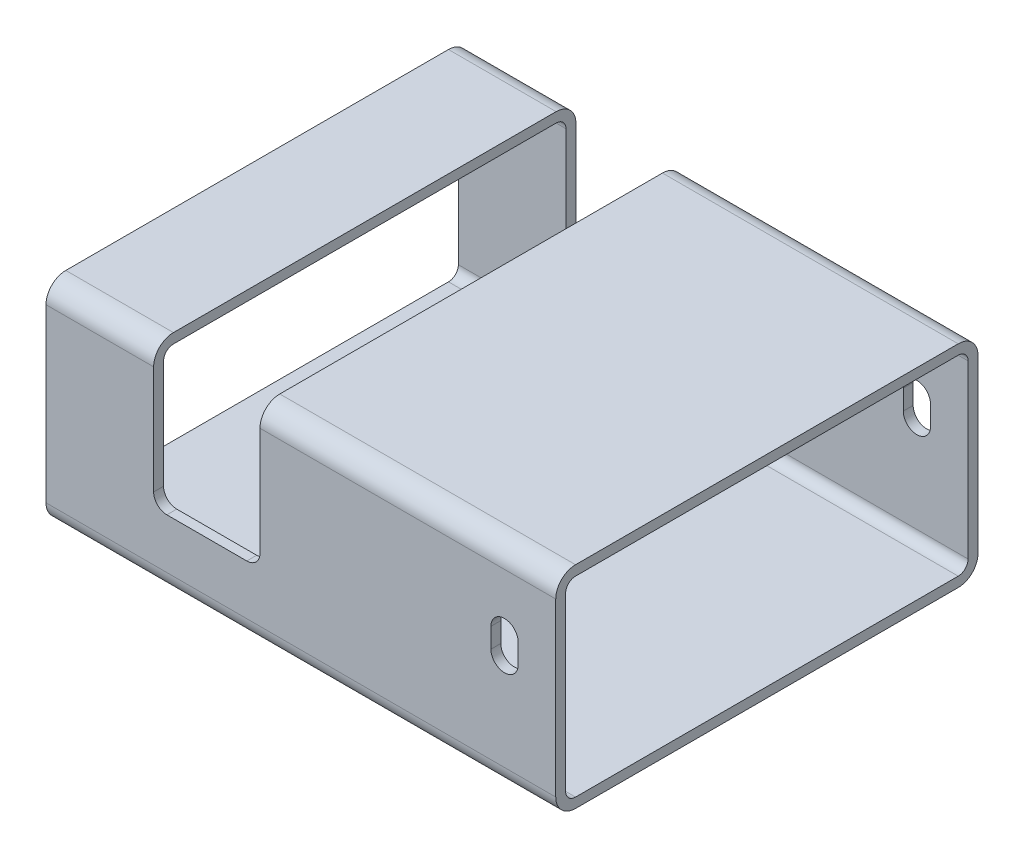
ISO-10303-21;
HEADER;
FILE_DESCRIPTION(('STEP AP214'),'2;1');
FILE_NAME('part.step','',(''),(''),'','','');
FILE_SCHEMA(('AUTOMOTIVE_DESIGN { 1 0 10303 214 1 1 1 1 }'));
ENDSEC;
DATA;
#1=APPLICATION_CONTEXT('core data for automotive mechanical design processes');
#2=APPLICATION_PROTOCOL_DEFINITION('international standard','automotive_design',2000,#1);
#3=PRODUCT_CONTEXT('',#1,'mechanical');
#4=PRODUCT('Part','Part','',(#3));
#5=PRODUCT_RELATED_PRODUCT_CATEGORY('part','',(#4));
#6=PRODUCT_DEFINITION_FORMATION('','',#4);
#7=PRODUCT_DEFINITION_CONTEXT('part definition',#1,'design');
#8=PRODUCT_DEFINITION('design','',#6,#7);
#9=PRODUCT_DEFINITION_SHAPE('','',#8);
#10=(LENGTH_UNIT() NAMED_UNIT(*) SI_UNIT(.MILLI.,.METRE.));
#11=(NAMED_UNIT(*) PLANE_ANGLE_UNIT() SI_UNIT($,.RADIAN.));
#12=(NAMED_UNIT(*) SI_UNIT($,.STERADIAN.) SOLID_ANGLE_UNIT());
#13=UNCERTAINTY_MEASURE_WITH_UNIT(LENGTH_MEASURE(1.E-05),#10,'distance_accuracy_value','');
#14=(GEOMETRIC_REPRESENTATION_CONTEXT(3) GLOBAL_UNCERTAINTY_ASSIGNED_CONTEXT((#13)) GLOBAL_UNIT_ASSIGNED_CONTEXT((#10,
#11,#12)) REPRESENTATION_CONTEXT('',''));
#15=CARTESIAN_POINT('',(0.,0.,0.));
#16=DIRECTION('',(0.,0.,1.));
#17=DIRECTION('',(1.,0.,0.));
#18=AXIS2_PLACEMENT_3D('',#15,#16,#17);
#19=CARTESIAN_POINT('',(245.3005,41.275,92.075));
#20=DIRECTION('',(-1.,0.,0.));
#21=DIRECTION('',(0.,0.,1.));
#22=AXIS2_PLACEMENT_3D('',#19,#20,#21);
#23=CYLINDRICAL_SURFACE('',#22,9.52499999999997);
#24=DIRECTION('',(-1.,0.,0.));
#25=VECTOR('',#24,1.);
#26=CARTESIAN_POINT('',(245.3005,50.8,92.075));
#27=LINE('',#26,#25);
#28=CARTESIAN_POINT('',(245.3005,50.8,92.075));
#29=VERTEX_POINT('',#28);
#30=CARTESIAN_POINT('',(102.981,50.8,92.075));
#31=VERTEX_POINT('',#30);
#32=EDGE_CURVE('E539',#29,#31,#27,.T.);
#33=ORIENTED_EDGE('',*,*,#32,.T.);
#34=CARTESIAN_POINT('',(102.981,41.275,92.075));
#35=DIRECTION('',(1.,0.,0.));
#36=DIRECTION('',(0.,0.,-1.));
#37=AXIS2_PLACEMENT_3D('',#34,#35,#36);
#38=CIRCLE('',#37,9.52499999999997);
#39=CARTESIAN_POINT('',(102.981,41.275,101.6));
#40=VERTEX_POINT('',#39);
#41=EDGE_CURVE('E383',#31,#40,#38,.T.);
#42=ORIENTED_EDGE('',*,*,#41,.T.);
#43=DIRECTION('',(-1.,0.,0.));
#44=VECTOR('',#43,1.);
#45=CARTESIAN_POINT('',(245.3005,41.275,101.6));
#46=LINE('',#45,#44);
#47=CARTESIAN_POINT('',(245.3005,41.275,101.6));
#48=VERTEX_POINT('',#47);
#49=EDGE_CURVE('E562',#48,#40,#46,.T.);
#50=ORIENTED_EDGE('',*,*,#49,.F.);
#51=CARTESIAN_POINT('',(245.3005,41.275,92.075));
#52=DIRECTION('',(1.,0.,0.));
#53=DIRECTION('',(0.,0.,-1.));
#54=AXIS2_PLACEMENT_3D('',#51,#52,#53);
#55=CIRCLE('',#54,9.52499999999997);
#56=EDGE_CURVE('E503',#29,#48,#55,.T.);
#57=ORIENTED_EDGE('',*,*,#56,.F.);
#58=EDGE_LOOP('',(#33,#42,#50,#57));
#59=FACE_BOUND('',#58,.T.);
#60=ADVANCED_FACE('F41',(#59),#23,.T.);
#61=CARTESIAN_POINT('',(245.3005,41.275,101.6));
#62=DIRECTION('',(0.,0.,-1.));
#63=DIRECTION('',(-1.,0.,0.));
#64=AXIS2_PLACEMENT_3D('',#61,#62,#63);
#65=PLANE('',#64);
#66=DIRECTION('',(0.,1.,0.));
#67=VECTOR('',#66,1.);
#68=CARTESIAN_POINT('',(227.1949375,4.7625,101.6));
#69=LINE('',#68,#67);
#70=CARTESIAN_POINT('',(227.1949375,4.7625,101.6));
#71=VERTEX_POINT('',#70);
#72=CARTESIAN_POINT('',(227.1949375,14.2875,101.6));
#73=VERTEX_POINT('',#72);
#74=EDGE_CURVE('E389',#71,#73,#69,.T.);
#75=ORIENTED_EDGE('',*,*,#74,.F.);
#76=CARTESIAN_POINT('',(220.6465,4.7625,101.6));
#77=DIRECTION('',(0.,0.,1.));
#78=DIRECTION('',(1.,0.,0.));
#79=AXIS2_PLACEMENT_3D('',#76,#77,#78);
#80=CIRCLE('',#79,6.54843749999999);
#81=CARTESIAN_POINT('',(214.0980625,4.7625,101.6));
#82=VERTEX_POINT('',#81);
#83=EDGE_CURVE('E387',#82,#71,#80,.T.);
#84=ORIENTED_EDGE('',*,*,#83,.F.);
#85=DIRECTION('',(0.,-1.,0.));
#86=VECTOR('',#85,1.);
#87=CARTESIAN_POINT('',(214.0980625,4.7625,101.6));
#88=LINE('',#87,#86);
#89=CARTESIAN_POINT('',(214.0980625,14.2875,101.6));
#90=VERTEX_POINT('',#89);
#91=EDGE_CURVE('E397',#90,#82,#88,.T.);
#92=ORIENTED_EDGE('',*,*,#91,.F.);
#93=CARTESIAN_POINT('',(220.6465,14.2875,101.6));
#94=DIRECTION('',(0.,0.,1.));
#95=DIRECTION('',(1.,0.,0.));
#96=AXIS2_PLACEMENT_3D('',#93,#94,#95);
#97=CIRCLE('',#96,6.54843749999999);
#98=EDGE_CURVE('E393',#73,#90,#97,.T.);
#99=ORIENTED_EDGE('',*,*,#98,.F.);
#100=EDGE_LOOP('',(#75,#84,#92,#99));
#101=FACE_BOUND('',#100,.T.);
#102=DIRECTION('',(0.,-1.,0.));
#103=VECTOR('',#102,1.);
#104=CARTESIAN_POINT('',(51.8,-10.8584999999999,101.6));
#105=LINE('',#104,#103);
#106=CARTESIAN_POINT('',(51.8,41.275,101.6));
#107=VERTEX_POINT('',#106);
#108=CARTESIAN_POINT('',(51.8,-10.8584999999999,101.6));
#109=VERTEX_POINT('',#108);
#110=EDGE_CURVE('E295',#107,#109,#105,.T.);
#111=ORIENTED_EDGE('',*,*,#110,.F.);
#112=CARTESIAN_POINT('',(0.,41.275,101.6));
#113=VERTEX_POINT('',#112);
#114=EDGE_CURVE('E563',#107,#113,#46,.T.);
#115=ORIENTED_EDGE('',*,*,#114,.T.);
#116=DIRECTION('',(0.,-1.,0.));
#117=VECTOR('',#116,1.);
#118=CARTESIAN_POINT('',(0.,41.275,101.6));
#119=LINE('',#118,#117);
#120=CARTESIAN_POINT('',(0.,-41.275,101.6));
#121=VERTEX_POINT('',#120);
#122=EDGE_CURVE('E522',#113,#121,#119,.T.);
#123=ORIENTED_EDGE('',*,*,#122,.T.);
#124=DIRECTION('',(-1.,0.,0.));
#125=VECTOR('',#124,1.);
#126=CARTESIAN_POINT('',(245.3005,-41.275,101.6));
#127=LINE('',#126,#125);
#128=CARTESIAN_POINT('',(245.3005,-41.275,101.6));
#129=VERTEX_POINT('',#128);
#130=EDGE_CURVE('E557',#129,#121,#127,.T.);
#131=ORIENTED_EDGE('',*,*,#130,.F.);
#132=DIRECTION('',(0.,-1.,0.));
#133=VECTOR('',#132,1.);
#134=CARTESIAN_POINT('',(245.3005,41.275,101.6));
#135=LINE('',#134,#133);
#136=EDGE_CURVE('E506',#48,#129,#135,.T.);
#137=ORIENTED_EDGE('',*,*,#136,.F.);
#138=ORIENTED_EDGE('',*,*,#49,.T.);
#139=DIRECTION('',(0.,1.,0.));
#140=VECTOR('',#139,1.);
#141=CARTESIAN_POINT('',(102.981,-10.8584999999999,101.6));
#142=LINE('',#141,#140);
#143=CARTESIAN_POINT('',(102.981,-10.8584999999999,101.6));
#144=VERTEX_POINT('',#143);
#145=EDGE_CURVE('E323',#144,#40,#142,.T.);
#146=ORIENTED_EDGE('',*,*,#145,.F.);
#147=CARTESIAN_POINT('',(96.631,-10.8585,101.6));
#148=DIRECTION('',(0.,0.,1.));
#149=DIRECTION('',(1.,0.,0.));
#150=AXIS2_PLACEMENT_3D('',#147,#148,#149);
#151=CIRCLE('',#150,6.35);
#152=CARTESIAN_POINT('',(96.6309999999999,-17.2085,101.6));
#153=VERTEX_POINT('',#152);
#154=EDGE_CURVE('E316',#153,#144,#151,.T.);
#155=ORIENTED_EDGE('',*,*,#154,.F.);
#156=DIRECTION('',(1.,0.,0.));
#157=VECTOR('',#156,1.);
#158=CARTESIAN_POINT('',(58.15,-17.2085,101.6));
#159=LINE('',#158,#157);
#160=CARTESIAN_POINT('',(58.15,-17.2085,101.6));
#161=VERTEX_POINT('',#160);
#162=EDGE_CURVE('E320',#161,#153,#159,.T.);
#163=ORIENTED_EDGE('',*,*,#162,.F.);
#164=CARTESIAN_POINT('',(58.15,-10.8585,101.6));
#165=DIRECTION('',(0.,0.,1.));
#166=DIRECTION('',(1.,0.,0.));
#167=AXIS2_PLACEMENT_3D('',#164,#165,#166);
#168=CIRCLE('',#167,6.35);
#169=EDGE_CURVE('E301',#109,#161,#168,.T.);
#170=ORIENTED_EDGE('',*,*,#169,.F.);
#171=EDGE_LOOP('',(#111,#115,#123,#131,#137,#138,#146,#155,#163,#170));
#172=FACE_BOUND('',#171,.T.);
#173=ADVANCED_FACE('F313',(#101,#172),#65,.F.);
#174=CARTESIAN_POINT('',(245.3005,41.275,-92.075));
#175=DIRECTION('',(-1.,0.,0.));
#176=DIRECTION('',(0.,0.,1.));
#177=AXIS2_PLACEMENT_3D('',#174,#175,#176);
#178=CYLINDRICAL_SURFACE('',#177,9.525);
#179=DIRECTION('',(-1.,0.,0.));
#180=VECTOR('',#179,1.);
#181=CARTESIAN_POINT('',(245.3005,41.275,-101.6));
#182=LINE('',#181,#180);
#183=CARTESIAN_POINT('',(245.3005,41.275,-101.6));
#184=VERTEX_POINT('',#183);
#185=CARTESIAN_POINT('',(102.981,41.275,-101.6));
#186=VERTEX_POINT('',#185);
#187=EDGE_CURVE('E550',#184,#186,#182,.T.);
#188=ORIENTED_EDGE('',*,*,#187,.T.);
#189=CARTESIAN_POINT('',(102.981,41.275,-92.075));
#190=DIRECTION('',(1.,0.,0.));
#191=DIRECTION('',(0.,0.,-1.));
#192=AXIS2_PLACEMENT_3D('',#189,#190,#191);
#193=CIRCLE('',#192,9.525);
#194=CARTESIAN_POINT('',(102.981,50.8,-92.075));
#195=VERTEX_POINT('',#194);
#196=EDGE_CURVE('E385',#186,#195,#193,.T.);
#197=ORIENTED_EDGE('',*,*,#196,.T.);
#198=DIRECTION('',(-1.,0.,0.));
#199=VECTOR('',#198,1.);
#200=CARTESIAN_POINT('',(245.3005,50.8,-92.075));
#201=LINE('',#200,#199);
#202=CARTESIAN_POINT('',(245.3005,50.8,-92.075));
#203=VERTEX_POINT('',#202);
#204=EDGE_CURVE('E542',#203,#195,#201,.T.);
#205=ORIENTED_EDGE('',*,*,#204,.F.);
#206=CARTESIAN_POINT('',(245.3005,41.275,-92.075));
#207=DIRECTION('',(1.,0.,0.));
#208=DIRECTION('',(0.,0.,-1.));
#209=AXIS2_PLACEMENT_3D('',#206,#207,#208);
#210=CIRCLE('',#209,9.525);
#211=EDGE_CURVE('E520',#184,#203,#210,.T.);
#212=ORIENTED_EDGE('',*,*,#211,.F.);
#213=EDGE_LOOP('',(#188,#197,#205,#212));
#214=FACE_BOUND('',#213,.T.);
#215=ADVANCED_FACE('F668',(#214),#178,.T.);
#216=CARTESIAN_POINT('',(245.3005,50.8,92.075));
#217=DIRECTION('',(0.,-1.,0.));
#218=DIRECTION('',(0.,0.,-1.));
#219=AXIS2_PLACEMENT_3D('',#216,#217,#218);
#220=PLANE('',#219);
#221=ORIENTED_EDGE('',*,*,#204,.T.);
#222=DIRECTION('',(0.,0.,1.));
#223=VECTOR('',#222,1.);
#224=CARTESIAN_POINT('',(102.981,50.8,92.075));
#225=LINE('',#224,#223);
#226=EDGE_CURVE('E378',#195,#31,#225,.T.);
#227=ORIENTED_EDGE('',*,*,#226,.T.);
#228=ORIENTED_EDGE('',*,*,#32,.F.);
#229=DIRECTION('',(0.,0.,1.));
#230=VECTOR('',#229,1.);
#231=CARTESIAN_POINT('',(245.3005,50.8,92.075));
#232=LINE('',#231,#230);
#233=EDGE_CURVE('E518',#203,#29,#232,.T.);
#234=ORIENTED_EDGE('',*,*,#233,.F.);
#235=EDGE_LOOP('',(#221,#227,#228,#234));
#236=FACE_BOUND('',#235,.T.);
#237=ADVANCED_FACE('F664',(#236),#220,.F.);
#238=CARTESIAN_POINT('',(245.3005,41.275,-92.075));
#239=DIRECTION('',(-1.,0.,0.));
#240=DIRECTION('',(0.,0.,1.));
#241=AXIS2_PLACEMENT_3D('',#238,#239,#240);
#242=CYLINDRICAL_SURFACE('',#241,4.7625);
#243=CARTESIAN_POINT('',(102.981,41.275,-92.075));
#244=DIRECTION('',(1.,0.,0.));
#245=DIRECTION('',(0.,0.,-1.));
#246=AXIS2_PLACEMENT_3D('',#243,#244,#245);
#247=CIRCLE('',#246,4.7625);
#248=CARTESIAN_POINT('',(102.981,41.275,-96.8375));
#249=VERTEX_POINT('',#248);
#250=CARTESIAN_POINT('',(102.981,46.0375,-92.075));
#251=VERTEX_POINT('',#250);
#252=EDGE_CURVE('E374',#249,#251,#247,.T.);
#253=ORIENTED_EDGE('',*,*,#252,.F.);
#254=DIRECTION('',(-1.,0.,0.));
#255=VECTOR('',#254,1.);
#256=CARTESIAN_POINT('',(245.3005,41.275,-96.8375));
#257=LINE('',#256,#255);
#258=CARTESIAN_POINT('',(245.3005,41.275,-96.8375));
#259=VERTEX_POINT('',#258);
#260=EDGE_CURVE('E495',#259,#249,#257,.T.);
#261=ORIENTED_EDGE('',*,*,#260,.F.);
#262=CARTESIAN_POINT('',(245.3005,41.275,-92.075));
#263=DIRECTION('',(1.,0.,0.));
#264=DIRECTION('',(0.,0.,-1.));
#265=AXIS2_PLACEMENT_3D('',#262,#263,#264);
#266=CIRCLE('',#265,4.7625);
#267=CARTESIAN_POINT('',(245.3005,46.0375,-92.075));
#268=VERTEX_POINT('',#267);
#269=EDGE_CURVE('E444',#259,#268,#266,.T.);
#270=ORIENTED_EDGE('',*,*,#269,.T.);
#271=DIRECTION('',(-1.,0.,0.));
#272=VECTOR('',#271,1.);
#273=CARTESIAN_POINT('',(245.3005,46.0375,-92.075));
#274=LINE('',#273,#272);
#275=EDGE_CURVE('E486',#268,#251,#274,.T.);
#276=ORIENTED_EDGE('',*,*,#275,.T.);
#277=EDGE_LOOP('',(#253,#261,#270,#276));
#278=FACE_BOUND('',#277,.T.);
#279=ADVANCED_FACE('F682',(#278),#242,.F.);
#280=CARTESIAN_POINT('',(245.3005,46.0375,92.075));
#281=DIRECTION('',(0.,-1.,0.));
#282=DIRECTION('',(0.,0.,-1.));
#283=AXIS2_PLACEMENT_3D('',#280,#281,#282);
#284=PLANE('',#283);
#285=DIRECTION('',(0.,0.,1.));
#286=VECTOR('',#285,1.);
#287=CARTESIAN_POINT('',(102.981,46.0375,92.075));
#288=LINE('',#287,#286);
#289=CARTESIAN_POINT('',(102.981,46.0375,92.075));
#290=VERTEX_POINT('',#289);
#291=EDGE_CURVE('E373',#251,#290,#288,.T.);
#292=ORIENTED_EDGE('',*,*,#291,.F.);
#293=ORIENTED_EDGE('',*,*,#275,.F.);
#294=DIRECTION('',(0.,0.,1.));
#295=VECTOR('',#294,1.);
#296=CARTESIAN_POINT('',(245.3005,46.0375,92.075));
#297=LINE('',#296,#295);
#298=CARTESIAN_POINT('',(245.3005,46.0375,92.075));
#299=VERTEX_POINT('',#298);
#300=EDGE_CURVE('E450',#268,#299,#297,.T.);
#301=ORIENTED_EDGE('',*,*,#300,.T.);
#302=DIRECTION('',(-1.,0.,0.));
#303=VECTOR('',#302,1.);
#304=CARTESIAN_POINT('',(245.3005,46.0375,92.075));
#305=LINE('',#304,#303);
#306=EDGE_CURVE('E481',#299,#290,#305,.T.);
#307=ORIENTED_EDGE('',*,*,#306,.T.);
#308=EDGE_LOOP('',(#292,#293,#301,#307));
#309=FACE_BOUND('',#308,.T.);
#310=ADVANCED_FACE('F695',(#309),#284,.T.);
#311=CARTESIAN_POINT('',(245.3005,41.275,92.075));
#312=DIRECTION('',(-1.,0.,0.));
#313=DIRECTION('',(0.,0.,1.));
#314=AXIS2_PLACEMENT_3D('',#311,#312,#313);
#315=CYLINDRICAL_SURFACE('',#314,4.76250000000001);
#316=CARTESIAN_POINT('',(102.981,41.275,92.075));
#317=DIRECTION('',(1.,0.,0.));
#318=DIRECTION('',(0.,0.,-1.));
#319=AXIS2_PLACEMENT_3D('',#316,#317,#318);
#320=CIRCLE('',#319,4.76250000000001);
#321=CARTESIAN_POINT('',(102.981,41.275,96.8375));
#322=VERTEX_POINT('',#321);
#323=EDGE_CURVE('E371',#290,#322,#320,.T.);
#324=ORIENTED_EDGE('',*,*,#323,.F.);
#325=ORIENTED_EDGE('',*,*,#306,.F.);
#326=CARTESIAN_POINT('',(245.3005,41.275,92.075));
#327=DIRECTION('',(1.,0.,0.));
#328=DIRECTION('',(0.,0.,-1.));
#329=AXIS2_PLACEMENT_3D('',#326,#327,#328);
#330=CIRCLE('',#329,4.76250000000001);
#331=CARTESIAN_POINT('',(245.3005,41.275,96.8375));
#332=VERTEX_POINT('',#331);
#333=EDGE_CURVE('E446',#299,#332,#330,.T.);
#334=ORIENTED_EDGE('',*,*,#333,.T.);
#335=DIRECTION('',(-1.,0.,0.));
#336=VECTOR('',#335,1.);
#337=CARTESIAN_POINT('',(245.3005,41.275,96.8375));
#338=LINE('',#337,#336);
#339=EDGE_CURVE('E479',#332,#322,#338,.T.);
#340=ORIENTED_EDGE('',*,*,#339,.T.);
#341=EDGE_LOOP('',(#324,#325,#334,#340));
#342=FACE_BOUND('',#341,.T.);
#343=ADVANCED_FACE('F694',(#342),#315,.F.);
#344=CARTESIAN_POINT('',(245.3005,41.275,92.075));
#345=DIRECTION('',(1.,0.,0.));
#346=DIRECTION('',(0.,0.,-1.));
#347=AXIS2_PLACEMENT_3D('',#344,#345,#346);
#348=PLANE('',#347);
#349=ORIENTED_EDGE('',*,*,#56,.T.);
#350=ORIENTED_EDGE('',*,*,#136,.T.);
#351=CARTESIAN_POINT('',(245.3005,-41.275,92.075));
#352=DIRECTION('',(1.,0.,0.));
#353=DIRECTION('',(0.,0.,-1.));
#354=AXIS2_PLACEMENT_3D('',#351,#352,#353);
#355=CIRCLE('',#354,9.52499999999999);
#356=CARTESIAN_POINT('',(245.3005,-50.8,92.075));
#357=VERTEX_POINT('',#356);
#358=EDGE_CURVE('E508',#129,#357,#355,.T.);
#359=ORIENTED_EDGE('',*,*,#358,.T.);
#360=DIRECTION('',(0.,0.,-1.));
#361=VECTOR('',#360,1.);
#362=CARTESIAN_POINT('',(245.3005,-50.8,-92.075));
#363=LINE('',#362,#361);
#364=CARTESIAN_POINT('',(245.3005,-50.8,-92.075));
#365=VERTEX_POINT('',#364);
#366=EDGE_CURVE('E512',#357,#365,#363,.T.);
#367=ORIENTED_EDGE('',*,*,#366,.T.);
#368=CARTESIAN_POINT('',(245.3005,-41.275,-92.075));
#369=DIRECTION('',(1.,0.,0.));
#370=DIRECTION('',(0.,0.,-1.));
#371=AXIS2_PLACEMENT_3D('',#368,#369,#370);
#372=CIRCLE('',#371,9.52499999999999);
#373=CARTESIAN_POINT('',(245.3005,-41.275,-101.6));
#374=VERTEX_POINT('',#373);
#375=EDGE_CURVE('E514',#365,#374,#372,.T.);
#376=ORIENTED_EDGE('',*,*,#375,.T.);
#377=DIRECTION('',(0.,1.,0.));
#378=VECTOR('',#377,1.);
#379=CARTESIAN_POINT('',(245.3005,-41.275,-101.6));
#380=LINE('',#379,#378);
#381=EDGE_CURVE('E513',#374,#184,#380,.T.);
#382=ORIENTED_EDGE('',*,*,#381,.T.);
#383=ORIENTED_EDGE('',*,*,#211,.T.);
#384=ORIENTED_EDGE('',*,*,#233,.T.);
#385=EDGE_LOOP('',(#349,#350,#359,#367,#376,#382,#383,#384));
#386=FACE_BOUND('',#385,.T.);
#387=DIRECTION('',(0.,0.,-1.));
#388=VECTOR('',#387,1.);
#389=CARTESIAN_POINT('',(245.3005,-46.0375,-92.075));
#390=LINE('',#389,#388);
#391=CARTESIAN_POINT('',(245.3005,-46.0375,92.075));
#392=VERTEX_POINT('',#391);
#393=CARTESIAN_POINT('',(245.3005,-46.0375,-92.075));
#394=VERTEX_POINT('',#393);
#395=EDGE_CURVE('E438',#392,#394,#390,.T.);
#396=ORIENTED_EDGE('',*,*,#395,.F.);
#397=CARTESIAN_POINT('',(245.3005,-41.275,92.075));
#398=DIRECTION('',(1.,0.,0.));
#399=DIRECTION('',(0.,0.,-1.));
#400=AXIS2_PLACEMENT_3D('',#397,#398,#399);
#401=CIRCLE('',#400,4.7625);
#402=CARTESIAN_POINT('',(245.3005,-41.275,96.8375));
#403=VERTEX_POINT('',#402);
#404=EDGE_CURVE('E436',#403,#392,#401,.T.);
#405=ORIENTED_EDGE('',*,*,#404,.F.);
#406=DIRECTION('',(0.,-1.,0.));
#407=VECTOR('',#406,1.);
#408=CARTESIAN_POINT('',(245.3005,41.275,96.8375));
#409=LINE('',#408,#407);
#410=EDGE_CURVE('E455',#332,#403,#409,.T.);
#411=ORIENTED_EDGE('',*,*,#410,.F.);
#412=ORIENTED_EDGE('',*,*,#333,.F.);
#413=ORIENTED_EDGE('',*,*,#300,.F.);
#414=ORIENTED_EDGE('',*,*,#269,.F.);
#415=DIRECTION('',(0.,1.,0.));
#416=VECTOR('',#415,1.);
#417=CARTESIAN_POINT('',(245.3005,-41.275,-96.8375));
#418=LINE('',#417,#416);
#419=CARTESIAN_POINT('',(245.3005,-41.275,-96.8375));
#420=VERTEX_POINT('',#419);
#421=EDGE_CURVE('E442',#420,#259,#418,.T.);
#422=ORIENTED_EDGE('',*,*,#421,.F.);
#423=CARTESIAN_POINT('',(245.3005,-41.275,-92.075));
#424=DIRECTION('',(1.,0.,0.));
#425=DIRECTION('',(0.,0.,-1.));
#426=AXIS2_PLACEMENT_3D('',#423,#424,#425);
#427=CIRCLE('',#426,4.7625);
#428=EDGE_CURVE('E441',#394,#420,#427,.T.);
#429=ORIENTED_EDGE('',*,*,#428,.F.);
#430=EDGE_LOOP('',(#396,#405,#411,#412,#413,#414,#422,#429));
#431=FACE_BOUND('',#430,.T.);
#432=ADVANCED_FACE('F653',(#386,#431),#348,.T.);
#433=CARTESIAN_POINT('',(0.,41.275,92.075));
#434=DIRECTION('',(1.,0.,0.));
#435=DIRECTION('',(0.,0.,-1.));
#436=AXIS2_PLACEMENT_3D('',#433,#434,#435);
#437=PLANE('',#436);
#438=CARTESIAN_POINT('',(0.,41.275,92.075));
#439=DIRECTION('',(1.,0.,0.));
#440=DIRECTION('',(0.,0.,-1.));
#441=AXIS2_PLACEMENT_3D('',#438,#439,#440);
#442=CIRCLE('',#441,9.52499999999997);
#443=CARTESIAN_POINT('',(0.,50.8,92.075));
#444=VERTEX_POINT('',#443);
#445=EDGE_CURVE('E505',#444,#113,#442,.T.);
#446=ORIENTED_EDGE('',*,*,#445,.F.);
#447=DIRECTION('',(0.,0.,1.));
#448=VECTOR('',#447,1.);
#449=CARTESIAN_POINT('',(0.,50.8,92.075));
#450=LINE('',#449,#448);
#451=CARTESIAN_POINT('',(0.,50.8,-92.075));
#452=VERTEX_POINT('',#451);
#453=EDGE_CURVE('E510',#452,#444,#450,.T.);
#454=ORIENTED_EDGE('',*,*,#453,.F.);
#455=CARTESIAN_POINT('',(0.,41.275,-92.075));
#456=DIRECTION('',(1.,0.,0.));
#457=DIRECTION('',(0.,0.,-1.));
#458=AXIS2_PLACEMENT_3D('',#455,#456,#457);
#459=CIRCLE('',#458,9.525);
#460=CARTESIAN_POINT('',(0.,41.275,-101.6));
#461=VERTEX_POINT('',#460);
#462=EDGE_CURVE('E533',#461,#452,#459,.T.);
#463=ORIENTED_EDGE('',*,*,#462,.F.);
#464=DIRECTION('',(0.,1.,0.));
#465=VECTOR('',#464,1.);
#466=CARTESIAN_POINT('',(0.,-41.275,-101.6));
#467=LINE('',#466,#465);
#468=CARTESIAN_POINT('',(0.,-41.275,-101.6));
#469=VERTEX_POINT('',#468);
#470=EDGE_CURVE('E535',#469,#461,#467,.T.);
#471=ORIENTED_EDGE('',*,*,#470,.F.);
#472=CARTESIAN_POINT('',(0.,-41.275,-92.075));
#473=DIRECTION('',(1.,0.,0.));
#474=DIRECTION('',(0.,0.,-1.));
#475=AXIS2_PLACEMENT_3D('',#472,#473,#474);
#476=CIRCLE('',#475,9.52499999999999);
#477=CARTESIAN_POINT('',(0.,-50.8,-92.075));
#478=VERTEX_POINT('',#477);
#479=EDGE_CURVE('E528',#478,#469,#476,.T.);
#480=ORIENTED_EDGE('',*,*,#479,.F.);
#481=DIRECTION('',(0.,0.,-1.));
#482=VECTOR('',#481,1.);
#483=CARTESIAN_POINT('',(0.,-50.8,-92.075));
#484=LINE('',#483,#482);
#485=CARTESIAN_POINT('',(0.,-50.8,92.075));
#486=VERTEX_POINT('',#485);
#487=EDGE_CURVE('E530',#486,#478,#484,.T.);
#488=ORIENTED_EDGE('',*,*,#487,.F.);
#489=CARTESIAN_POINT('',(0.,-41.275,92.075));
#490=DIRECTION('',(1.,0.,0.));
#491=DIRECTION('',(0.,0.,-1.));
#492=AXIS2_PLACEMENT_3D('',#489,#490,#491);
#493=CIRCLE('',#492,9.52499999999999);
#494=EDGE_CURVE('E527',#121,#486,#493,.T.);
#495=ORIENTED_EDGE('',*,*,#494,.F.);
#496=ORIENTED_EDGE('',*,*,#122,.F.);
#497=EDGE_LOOP('',(#446,#454,#463,#471,#480,#488,#495,#496));
#498=FACE_BOUND('',#497,.T.);
#499=CARTESIAN_POINT('',(0.,-41.275,92.075));
#500=DIRECTION('',(1.,0.,0.));
#501=DIRECTION('',(0.,0.,-1.));
#502=AXIS2_PLACEMENT_3D('',#499,#500,#501);
#503=CIRCLE('',#502,4.7625);
#504=CARTESIAN_POINT('',(0.,-41.275,96.8375));
#505=VERTEX_POINT('',#504);
#506=CARTESIAN_POINT('',(0.,-46.0375,92.075));
#507=VERTEX_POINT('',#506);
#508=EDGE_CURVE('E434',#505,#507,#503,.T.);
#509=ORIENTED_EDGE('',*,*,#508,.T.);
#510=DIRECTION('',(0.,0.,-1.));
#511=VECTOR('',#510,1.);
#512=CARTESIAN_POINT('',(0.,-46.0375,-92.075));
#513=LINE('',#512,#511);
#514=CARTESIAN_POINT('',(0.,-46.0375,-92.075));
#515=VERTEX_POINT('',#514);
#516=EDGE_CURVE('E460',#507,#515,#513,.T.);
#517=ORIENTED_EDGE('',*,*,#516,.T.);
#518=CARTESIAN_POINT('',(0.,-41.275,-92.075));
#519=DIRECTION('',(1.,0.,0.));
#520=DIRECTION('',(0.,0.,-1.));
#521=AXIS2_PLACEMENT_3D('',#518,#519,#520);
#522=CIRCLE('',#521,4.7625);
#523=CARTESIAN_POINT('',(0.,-41.275,-96.8375));
#524=VERTEX_POINT('',#523);
#525=EDGE_CURVE('E459',#515,#524,#522,.T.);
#526=ORIENTED_EDGE('',*,*,#525,.T.);
#527=DIRECTION('',(0.,1.,0.));
#528=VECTOR('',#527,1.);
#529=CARTESIAN_POINT('',(0.,-41.275,-96.8375));
#530=LINE('',#529,#528);
#531=CARTESIAN_POINT('',(0.,41.275,-96.8375));
#532=VERTEX_POINT('',#531);
#533=EDGE_CURVE('E465',#524,#532,#530,.T.);
#534=ORIENTED_EDGE('',*,*,#533,.T.);
#535=CARTESIAN_POINT('',(0.,41.275,-92.075));
#536=DIRECTION('',(1.,0.,0.));
#537=DIRECTION('',(0.,0.,-1.));
#538=AXIS2_PLACEMENT_3D('',#535,#536,#537);
#539=CIRCLE('',#538,4.7625);
#540=CARTESIAN_POINT('',(0.,46.0375,-92.075));
#541=VERTEX_POINT('',#540);
#542=EDGE_CURVE('E467',#532,#541,#539,.T.);
#543=ORIENTED_EDGE('',*,*,#542,.T.);
#544=DIRECTION('',(0.,0.,1.));
#545=VECTOR('',#544,1.);
#546=CARTESIAN_POINT('',(0.,46.0375,92.075));
#547=LINE('',#546,#545);
#548=CARTESIAN_POINT('',(0.,46.0375,92.075));
#549=VERTEX_POINT('',#548);
#550=EDGE_CURVE('E469',#541,#549,#547,.T.);
#551=ORIENTED_EDGE('',*,*,#550,.T.);
#552=CARTESIAN_POINT('',(0.,41.275,92.075));
#553=DIRECTION('',(1.,0.,0.));
#554=DIRECTION('',(0.,0.,-1.));
#555=AXIS2_PLACEMENT_3D('',#552,#553,#554);
#556=CIRCLE('',#555,4.76250000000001);
#557=CARTESIAN_POINT('',(0.,41.275,96.8375));
#558=VERTEX_POINT('',#557);
#559=EDGE_CURVE('E475',#549,#558,#556,.T.);
#560=ORIENTED_EDGE('',*,*,#559,.T.);
#561=DIRECTION('',(0.,-1.,0.));
#562=VECTOR('',#561,1.);
#563=CARTESIAN_POINT('',(0.,41.275,96.8375));
#564=LINE('',#563,#562);
#565=EDGE_CURVE('E437',#558,#505,#564,.T.);
#566=ORIENTED_EDGE('',*,*,#565,.T.);
#567=EDGE_LOOP('',(#509,#517,#526,#534,#543,#551,#560,#566));
#568=FACE_BOUND('',#567,.T.);
#569=ADVANCED_FACE('F638',(#498,#568),#437,.F.);
#570=ORIENTED_EDGE('',*,*,#114,.F.);
#571=CARTESIAN_POINT('',(51.8,41.275,92.075));
#572=DIRECTION('',(-1.,0.,0.));
#573=DIRECTION('',(0.,-1.,0.));
#574=AXIS2_PLACEMENT_3D('',#571,#572,#573);
#575=CIRCLE('',#574,9.52499999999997);
#576=CARTESIAN_POINT('',(51.8,50.8,92.075));
#577=VERTEX_POINT('',#576);
#578=EDGE_CURVE('E300',#107,#577,#575,.T.);
#579=ORIENTED_EDGE('',*,*,#578,.T.);
#580=EDGE_CURVE('E521',#577,#444,#27,.T.);
#581=ORIENTED_EDGE('',*,*,#580,.T.);
#582=ORIENTED_EDGE('',*,*,#445,.T.);
#583=EDGE_LOOP('',(#570,#579,#581,#582));
#584=FACE_BOUND('',#583,.T.);
#585=ADVANCED_FACE('F43',(#584),#23,.T.);
#586=CARTESIAN_POINT('',(245.3005,-41.275,92.075));
#587=DIRECTION('',(-1.,0.,0.));
#588=DIRECTION('',(0.,0.,1.));
#589=AXIS2_PLACEMENT_3D('',#586,#587,#588);
#590=CYLINDRICAL_SURFACE('',#589,9.52499999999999);
#591=ORIENTED_EDGE('',*,*,#494,.T.);
#592=DIRECTION('',(-1.,0.,0.));
#593=VECTOR('',#592,1.);
#594=CARTESIAN_POINT('',(245.3005,-50.8,92.075));
#595=LINE('',#594,#593);
#596=EDGE_CURVE('E560',#357,#486,#595,.T.);
#597=ORIENTED_EDGE('',*,*,#596,.F.);
#598=ORIENTED_EDGE('',*,*,#358,.F.);
#599=ORIENTED_EDGE('',*,*,#130,.T.);
#600=EDGE_LOOP('',(#591,#597,#598,#599));
#601=FACE_BOUND('',#600,.T.);
#602=ADVANCED_FACE('F643',(#601),#590,.T.);
#603=CARTESIAN_POINT('',(245.3005,-50.8,-92.075));
#604=DIRECTION('',(0.,1.,0.));
#605=DIRECTION('',(0.,0.,1.));
#606=AXIS2_PLACEMENT_3D('',#603,#604,#605);
#607=PLANE('',#606);
#608=ORIENTED_EDGE('',*,*,#487,.T.);
#609=DIRECTION('',(-1.,0.,0.));
#610=VECTOR('',#609,1.);
#611=CARTESIAN_POINT('',(245.3005,-50.8,-92.075));
#612=LINE('',#611,#610);
#613=EDGE_CURVE('E555',#365,#478,#612,.T.);
#614=ORIENTED_EDGE('',*,*,#613,.F.);
#615=ORIENTED_EDGE('',*,*,#366,.F.);
#616=ORIENTED_EDGE('',*,*,#596,.T.);
#617=EDGE_LOOP('',(#608,#614,#615,#616));
#618=FACE_BOUND('',#617,.T.);
#619=ADVANCED_FACE('F648',(#618),#607,.F.);
#620=CARTESIAN_POINT('',(245.3005,-41.275,-92.075));
#621=DIRECTION('',(-1.,0.,0.));
#622=DIRECTION('',(0.,0.,1.));
#623=AXIS2_PLACEMENT_3D('',#620,#621,#622);
#624=CYLINDRICAL_SURFACE('',#623,9.52499999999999);
#625=ORIENTED_EDGE('',*,*,#479,.T.);
#626=DIRECTION('',(-1.,0.,0.));
#627=VECTOR('',#626,1.);
#628=CARTESIAN_POINT('',(245.3005,-41.275,-101.6));
#629=LINE('',#628,#627);
#630=EDGE_CURVE('E553',#374,#469,#629,.T.);
#631=ORIENTED_EDGE('',*,*,#630,.F.);
#632=ORIENTED_EDGE('',*,*,#375,.F.);
#633=ORIENTED_EDGE('',*,*,#613,.T.);
#634=EDGE_LOOP('',(#625,#631,#632,#633));
#635=FACE_BOUND('',#634,.T.);
#636=ADVANCED_FACE('F731',(#635),#624,.T.);
#637=CARTESIAN_POINT('',(245.3005,-41.275,-101.6));
#638=DIRECTION('',(0.,0.,1.));
#639=DIRECTION('',(1.,0.,0.));
#640=AXIS2_PLACEMENT_3D('',#637,#638,#639);
#641=PLANE('',#640);
#642=DIRECTION('',(0.,-1.,0.));
#643=VECTOR('',#642,1.);
#644=CARTESIAN_POINT('',(214.0980625,4.7625,-101.6));
#645=LINE('',#644,#643);
#646=CARTESIAN_POINT('',(214.0980625,14.2875,-101.6));
#647=VERTEX_POINT('',#646);
#648=CARTESIAN_POINT('',(214.0980625,4.7625,-101.6));
#649=VERTEX_POINT('',#648);
#650=EDGE_CURVE('E407',#647,#649,#645,.T.);
#651=ORIENTED_EDGE('',*,*,#650,.T.);
#652=CARTESIAN_POINT('',(220.6465,4.7625,-101.6));
#653=DIRECTION('',(0.,0.,1.));
#654=DIRECTION('',(1.,0.,0.));
#655=AXIS2_PLACEMENT_3D('',#652,#653,#654);
#656=CIRCLE('',#655,6.54843749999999);
#657=CARTESIAN_POINT('',(227.1949375,4.7625,-101.6));
#658=VERTEX_POINT('',#657);
#659=EDGE_CURVE('E396',#649,#658,#656,.T.);
#660=ORIENTED_EDGE('',*,*,#659,.T.);
#661=DIRECTION('',(0.,1.,0.));
#662=VECTOR('',#661,1.);
#663=CARTESIAN_POINT('',(227.1949375,4.7625,-101.6));
#664=LINE('',#663,#662);
#665=CARTESIAN_POINT('',(227.1949375,14.2875,-101.6));
#666=VERTEX_POINT('',#665);
#667=EDGE_CURVE('E405',#658,#666,#664,.T.);
#668=ORIENTED_EDGE('',*,*,#667,.T.);
#669=CARTESIAN_POINT('',(220.6465,14.2875,-101.6));
#670=DIRECTION('',(0.,0.,1.));
#671=DIRECTION('',(1.,0.,0.));
#672=AXIS2_PLACEMENT_3D('',#669,#670,#671);
#673=CIRCLE('',#672,6.54843749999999);
#674=EDGE_CURVE('E403',#666,#647,#673,.T.);
#675=ORIENTED_EDGE('',*,*,#674,.T.);
#676=EDGE_LOOP('',(#651,#660,#668,#675));
#677=FACE_BOUND('',#676,.T.);
#678=CARTESIAN_POINT('',(96.631,-10.8585,-101.6));
#679=DIRECTION('',(0.,0.,1.));
#680=DIRECTION('',(1.,0.,0.));
#681=AXIS2_PLACEMENT_3D('',#678,#679,#680);
#682=CIRCLE('',#681,6.35);
#683=CARTESIAN_POINT('',(96.6309999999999,-17.2085,-101.6));
#684=VERTEX_POINT('',#683);
#685=CARTESIAN_POINT('',(102.981,-10.8584999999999,-101.6));
#686=VERTEX_POINT('',#685);
#687=EDGE_CURVE('E333',#684,#686,#682,.T.);
#688=ORIENTED_EDGE('',*,*,#687,.T.);
#689=DIRECTION('',(0.,1.,0.));
#690=VECTOR('',#689,1.);
#691=CARTESIAN_POINT('',(102.981,-10.8584999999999,-101.6));
#692=LINE('',#691,#690);
#693=EDGE_CURVE('E315',#686,#186,#692,.T.);
#694=ORIENTED_EDGE('',*,*,#693,.T.);
#695=ORIENTED_EDGE('',*,*,#187,.F.);
#696=ORIENTED_EDGE('',*,*,#381,.F.);
#697=ORIENTED_EDGE('',*,*,#630,.T.);
#698=ORIENTED_EDGE('',*,*,#470,.T.);
#699=CARTESIAN_POINT('',(51.8,41.275,-101.6));
#700=VERTEX_POINT('',#699);
#701=EDGE_CURVE('E549',#700,#461,#182,.T.);
#702=ORIENTED_EDGE('',*,*,#701,.F.);
#703=DIRECTION('',(0.,-1.,0.));
#704=VECTOR('',#703,1.);
#705=CARTESIAN_POINT('',(51.8,-10.8584999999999,-101.6));
#706=LINE('',#705,#704);
#707=CARTESIAN_POINT('',(51.8,-10.8584999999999,-101.6));
#708=VERTEX_POINT('',#707);
#709=EDGE_CURVE('E326',#700,#708,#706,.T.);
#710=ORIENTED_EDGE('',*,*,#709,.T.);
#711=CARTESIAN_POINT('',(58.15,-10.8585,-101.6));
#712=DIRECTION('',(0.,0.,1.));
#713=DIRECTION('',(1.,0.,0.));
#714=AXIS2_PLACEMENT_3D('',#711,#712,#713);
#715=CIRCLE('',#714,6.35);
#716=CARTESIAN_POINT('',(58.15,-17.2085,-101.6));
#717=VERTEX_POINT('',#716);
#718=EDGE_CURVE('E327',#708,#717,#715,.T.);
#719=ORIENTED_EDGE('',*,*,#718,.T.);
#720=DIRECTION('',(1.,0.,0.));
#721=VECTOR('',#720,1.);
#722=CARTESIAN_POINT('',(58.15,-17.2085,-101.6));
#723=LINE('',#722,#721);
#724=EDGE_CURVE('E334',#717,#684,#723,.T.);
#725=ORIENTED_EDGE('',*,*,#724,.T.);
#726=EDGE_LOOP('',(#688,#694,#695,#696,#697,#698,#702,#710,#719,#725));
#727=FACE_BOUND('',#726,.T.);
#728=ADVANCED_FACE('F624',(#677,#727),#641,.F.);
#729=CARTESIAN_POINT('',(51.8,50.8,-92.075));
#730=VERTEX_POINT('',#729);
#731=EDGE_CURVE('E543',#730,#452,#201,.T.);
#732=ORIENTED_EDGE('',*,*,#731,.F.);
#733=CARTESIAN_POINT('',(51.8,41.275,-92.075));
#734=DIRECTION('',(-1.,0.,0.));
#735=DIRECTION('',(0.,-1.,0.));
#736=AXIS2_PLACEMENT_3D('',#733,#734,#735);
#737=CIRCLE('',#736,9.525);
#738=EDGE_CURVE('E57',#730,#700,#737,.T.);
#739=ORIENTED_EDGE('',*,*,#738,.T.);
#740=ORIENTED_EDGE('',*,*,#701,.T.);
#741=ORIENTED_EDGE('',*,*,#462,.T.);
#742=EDGE_LOOP('',(#732,#739,#740,#741));
#743=FACE_BOUND('',#742,.T.);
#744=ADVANCED_FACE('F630',(#743),#178,.T.);
#745=ORIENTED_EDGE('',*,*,#580,.F.);
#746=DIRECTION('',(0.,0.,-1.));
#747=VECTOR('',#746,1.);
#748=CARTESIAN_POINT('',(51.8,50.8,92.075));
#749=LINE('',#748,#747);
#750=EDGE_CURVE('E363',#577,#730,#749,.T.);
#751=ORIENTED_EDGE('',*,*,#750,.T.);
#752=ORIENTED_EDGE('',*,*,#731,.T.);
#753=ORIENTED_EDGE('',*,*,#453,.T.);
#754=EDGE_LOOP('',(#745,#751,#752,#753));
#755=FACE_BOUND('',#754,.T.);
#756=ADVANCED_FACE('F635',(#755),#220,.F.);
#757=CARTESIAN_POINT('',(245.3005,-41.275,92.075));
#758=DIRECTION('',(-1.,0.,0.));
#759=DIRECTION('',(0.,0.,1.));
#760=AXIS2_PLACEMENT_3D('',#757,#758,#759);
#761=CYLINDRICAL_SURFACE('',#760,4.7625);
#762=ORIENTED_EDGE('',*,*,#508,.F.);
#763=DIRECTION('',(-1.,0.,0.));
#764=VECTOR('',#763,1.);
#765=CARTESIAN_POINT('',(245.3005,-41.275,96.8375));
#766=LINE('',#765,#764);
#767=EDGE_CURVE('E453',#403,#505,#766,.T.);
#768=ORIENTED_EDGE('',*,*,#767,.F.);
#769=ORIENTED_EDGE('',*,*,#404,.T.);
#770=DIRECTION('',(-1.,0.,0.));
#771=VECTOR('',#770,1.);
#772=CARTESIAN_POINT('',(245.3005,-46.0375,92.075));
#773=LINE('',#772,#771);
#774=EDGE_CURVE('E497',#392,#507,#773,.T.);
#775=ORIENTED_EDGE('',*,*,#774,.T.);
#776=EDGE_LOOP('',(#762,#768,#769,#775));
#777=FACE_BOUND('',#776,.T.);
#778=ADVANCED_FACE('F697',(#777),#761,.F.);
#779=CARTESIAN_POINT('',(245.3005,-46.0375,-92.075));
#780=DIRECTION('',(0.,1.,0.));
#781=DIRECTION('',(0.,0.,1.));
#782=AXIS2_PLACEMENT_3D('',#779,#780,#781);
#783=PLANE('',#782);
#784=ORIENTED_EDGE('',*,*,#516,.F.);
#785=ORIENTED_EDGE('',*,*,#774,.F.);
#786=ORIENTED_EDGE('',*,*,#395,.T.);
#787=DIRECTION('',(-1.,0.,0.));
#788=VECTOR('',#787,1.);
#789=CARTESIAN_POINT('',(245.3005,-46.0375,-92.075));
#790=LINE('',#789,#788);
#791=EDGE_CURVE('E500',#394,#515,#790,.T.);
#792=ORIENTED_EDGE('',*,*,#791,.T.);
#793=EDGE_LOOP('',(#784,#785,#786,#792));
#794=FACE_BOUND('',#793,.T.);
#795=ADVANCED_FACE('F702',(#794),#783,.T.);
#796=CARTESIAN_POINT('',(245.3005,-41.275,-92.075));
#797=DIRECTION('',(-1.,0.,0.));
#798=DIRECTION('',(0.,0.,1.));
#799=AXIS2_PLACEMENT_3D('',#796,#797,#798);
#800=CYLINDRICAL_SURFACE('',#799,4.7625);
#801=ORIENTED_EDGE('',*,*,#525,.F.);
#802=ORIENTED_EDGE('',*,*,#791,.F.);
#803=ORIENTED_EDGE('',*,*,#428,.T.);
#804=DIRECTION('',(-1.,0.,0.));
#805=VECTOR('',#804,1.);
#806=CARTESIAN_POINT('',(245.3005,-41.275,-96.8375));
#807=LINE('',#806,#805);
#808=EDGE_CURVE('E492',#420,#524,#807,.T.);
#809=ORIENTED_EDGE('',*,*,#808,.T.);
#810=EDGE_LOOP('',(#801,#802,#803,#809));
#811=FACE_BOUND('',#810,.T.);
#812=ADVANCED_FACE('F707',(#811),#800,.F.);
#813=CARTESIAN_POINT('',(245.3005,-41.275,-96.8375));
#814=DIRECTION('',(0.,0.,1.));
#815=DIRECTION('',(0.,-1.,0.));
#816=AXIS2_PLACEMENT_3D('',#813,#814,#815);
#817=PLANE('',#816);
#818=DIRECTION('',(0.,1.,0.));
#819=VECTOR('',#818,1.);
#820=CARTESIAN_POINT('',(102.981,-41.275,-96.8375));
#821=LINE('',#820,#819);
#822=CARTESIAN_POINT('',(102.981,-10.8584999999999,-96.8375));
#823=VERTEX_POINT('',#822);
#824=EDGE_CURVE('E380',#823,#249,#821,.T.);
#825=ORIENTED_EDGE('',*,*,#824,.F.);
#826=CARTESIAN_POINT('',(96.631,-10.8585,-96.8375));
#827=DIRECTION('',(0.,0.,1.));
#828=DIRECTION('',(0.,-1.,0.));
#829=AXIS2_PLACEMENT_3D('',#826,#827,#828);
#830=CIRCLE('',#829,6.35);
#831=CARTESIAN_POINT('',(96.6309999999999,-17.2085,-96.8375));
#832=VERTEX_POINT('',#831);
#833=EDGE_CURVE('E367',#832,#823,#830,.T.);
#834=ORIENTED_EDGE('',*,*,#833,.F.);
#835=DIRECTION('',(1.,0.,0.));
#836=VECTOR('',#835,1.);
#837=CARTESIAN_POINT('',(245.3005,-17.2085,-96.8375));
#838=LINE('',#837,#836);
#839=CARTESIAN_POINT('',(58.15,-17.2085,-96.8375));
#840=VERTEX_POINT('',#839);
#841=EDGE_CURVE('E370',#840,#832,#838,.T.);
#842=ORIENTED_EDGE('',*,*,#841,.F.);
#843=CARTESIAN_POINT('',(58.15,-10.8585,-96.8375));
#844=DIRECTION('',(0.,0.,1.));
#845=DIRECTION('',(0.,-1.,0.));
#846=AXIS2_PLACEMENT_3D('',#843,#844,#845);
#847=CIRCLE('',#846,6.35);
#848=CARTESIAN_POINT('',(51.8,-10.8584999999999,-96.8375));
#849=VERTEX_POINT('',#848);
#850=EDGE_CURVE('E362',#849,#840,#847,.T.);
#851=ORIENTED_EDGE('',*,*,#850,.F.);
#852=DIRECTION('',(0.,-1.,0.));
#853=VECTOR('',#852,1.);
#854=CARTESIAN_POINT('',(51.8,-41.275,-96.8375));
#855=LINE('',#854,#853);
#856=CARTESIAN_POINT('',(51.8,41.275,-96.8375));
#857=VERTEX_POINT('',#856);
#858=EDGE_CURVE('E360',#857,#849,#855,.T.);
#859=ORIENTED_EDGE('',*,*,#858,.F.);
#860=EDGE_CURVE('E493',#857,#532,#257,.T.);
#861=ORIENTED_EDGE('',*,*,#860,.T.);
#862=ORIENTED_EDGE('',*,*,#533,.F.);
#863=ORIENTED_EDGE('',*,*,#808,.F.);
#864=ORIENTED_EDGE('',*,*,#421,.T.);
#865=ORIENTED_EDGE('',*,*,#260,.T.);
#866=EDGE_LOOP('',(#825,#834,#842,#851,#859,#861,#862,#863,#864,#865));
#867=FACE_BOUND('',#866,.T.);
#868=CARTESIAN_POINT('',(220.6465,4.7625,-96.8375));
#869=DIRECTION('',(0.,0.,1.));
#870=DIRECTION('',(0.,-1.,0.));
#871=AXIS2_PLACEMENT_3D('',#868,#869,#870);
#872=CIRCLE('',#871,6.54843749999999);
#873=CARTESIAN_POINT('',(214.0980625,4.7625,-96.8375));
#874=VERTEX_POINT('',#873);
#875=CARTESIAN_POINT('',(227.1949375,4.7625,-96.8375));
#876=VERTEX_POINT('',#875);
#877=EDGE_CURVE('E435',#874,#876,#872,.T.);
#878=ORIENTED_EDGE('',*,*,#877,.F.);
#879=DIRECTION('',(0.,-1.,0.));
#880=VECTOR('',#879,1.);
#881=CARTESIAN_POINT('',(214.0980625,-41.275,-96.8375));
#882=LINE('',#881,#880);
#883=CARTESIAN_POINT('',(214.0980625,14.2875,-96.8375));
#884=VERTEX_POINT('',#883);
#885=EDGE_CURVE('E427',#884,#874,#882,.T.);
#886=ORIENTED_EDGE('',*,*,#885,.F.);
#887=CARTESIAN_POINT('',(220.6465,14.2875,-96.8375));
#888=DIRECTION('',(0.,0.,1.));
#889=DIRECTION('',(0.,-1.,0.));
#890=AXIS2_PLACEMENT_3D('',#887,#888,#889);
#891=CIRCLE('',#890,6.54843749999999);
#892=CARTESIAN_POINT('',(227.1949375,14.2875,-96.8375));
#893=VERTEX_POINT('',#892);
#894=EDGE_CURVE('E426',#893,#884,#891,.T.);
#895=ORIENTED_EDGE('',*,*,#894,.F.);
#896=DIRECTION('',(0.,1.,0.));
#897=VECTOR('',#896,1.);
#898=CARTESIAN_POINT('',(227.1949375,-41.275,-96.8375));
#899=LINE('',#898,#897);
#900=EDGE_CURVE('E414',#876,#893,#899,.T.);
#901=ORIENTED_EDGE('',*,*,#900,.F.);
#902=EDGE_LOOP('',(#878,#886,#895,#901));
#903=FACE_BOUND('',#902,.T.);
#904=ADVANCED_FACE('F615',(#867,#903),#817,.T.);
#905=CARTESIAN_POINT('',(51.8,41.275,-92.075));
#906=DIRECTION('',(-1.,0.,0.));
#907=DIRECTION('',(0.,-1.,0.));
#908=AXIS2_PLACEMENT_3D('',#905,#906,#907);
#909=CIRCLE('',#908,4.7625);
#910=CARTESIAN_POINT('',(51.8,46.0375,-92.075));
#911=VERTEX_POINT('',#910);
#912=EDGE_CURVE('E357',#911,#857,#909,.T.);
#913=ORIENTED_EDGE('',*,*,#912,.F.);
#914=EDGE_CURVE('E487',#911,#541,#274,.T.);
#915=ORIENTED_EDGE('',*,*,#914,.T.);
#916=ORIENTED_EDGE('',*,*,#542,.F.);
#917=ORIENTED_EDGE('',*,*,#860,.F.);
#918=EDGE_LOOP('',(#913,#915,#916,#917));
#919=FACE_BOUND('',#918,.T.);
#920=ADVANCED_FACE('F608',(#919),#242,.F.);
#921=DIRECTION('',(0.,0.,-1.));
#922=VECTOR('',#921,1.);
#923=CARTESIAN_POINT('',(51.8,46.0375,92.075));
#924=LINE('',#923,#922);
#925=CARTESIAN_POINT('',(51.8,46.0375,92.075));
#926=VERTEX_POINT('',#925);
#927=EDGE_CURVE('E353',#926,#911,#924,.T.);
#928=ORIENTED_EDGE('',*,*,#927,.F.);
#929=EDGE_CURVE('E485',#926,#549,#305,.T.);
#930=ORIENTED_EDGE('',*,*,#929,.T.);
#931=ORIENTED_EDGE('',*,*,#550,.F.);
#932=ORIENTED_EDGE('',*,*,#914,.F.);
#933=EDGE_LOOP('',(#928,#930,#931,#932));
#934=FACE_BOUND('',#933,.T.);
#935=ADVANCED_FACE('F605',(#934),#284,.T.);
#936=CARTESIAN_POINT('',(51.8,41.275,92.075));
#937=DIRECTION('',(-1.,0.,0.));
#938=DIRECTION('',(0.,-1.,0.));
#939=AXIS2_PLACEMENT_3D('',#936,#937,#938);
#940=CIRCLE('',#939,4.76250000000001);
#941=CARTESIAN_POINT('',(51.8,41.275,96.8375));
#942=VERTEX_POINT('',#941);
#943=EDGE_CURVE('E342',#942,#926,#940,.T.);
#944=ORIENTED_EDGE('',*,*,#943,.F.);
#945=EDGE_CURVE('E477',#942,#558,#338,.T.);
#946=ORIENTED_EDGE('',*,*,#945,.T.);
#947=ORIENTED_EDGE('',*,*,#559,.F.);
#948=ORIENTED_EDGE('',*,*,#929,.F.);
#949=EDGE_LOOP('',(#944,#946,#947,#948));
#950=FACE_BOUND('',#949,.T.);
#951=ADVANCED_FACE('F596',(#950),#315,.F.);
#952=CARTESIAN_POINT('',(245.3005,41.275,96.8375));
#953=DIRECTION('',(0.,0.,-1.));
#954=DIRECTION('',(-1.,0.,0.));
#955=AXIS2_PLACEMENT_3D('',#952,#953,#954);
#956=PLANE('',#955);
#957=DIRECTION('',(0.,-1.,0.));
#958=VECTOR('',#957,1.);
#959=CARTESIAN_POINT('',(102.981,41.275,96.8375));
#960=LINE('',#959,#958);
#961=CARTESIAN_POINT('',(102.981,-10.8584999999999,96.8375));
#962=VERTEX_POINT('',#961);
#963=EDGE_CURVE('E11',#322,#962,#960,.T.);
#964=ORIENTED_EDGE('',*,*,#963,.F.);
#965=ORIENTED_EDGE('',*,*,#339,.F.);
#966=ORIENTED_EDGE('',*,*,#410,.T.);
#967=ORIENTED_EDGE('',*,*,#767,.T.);
#968=ORIENTED_EDGE('',*,*,#565,.F.);
#969=ORIENTED_EDGE('',*,*,#945,.F.);
#970=DIRECTION('',(0.,1.,0.));
#971=VECTOR('',#970,1.);
#972=CARTESIAN_POINT('',(51.8,41.275,96.8375));
#973=LINE('',#972,#971);
#974=CARTESIAN_POINT('',(51.8,-10.8584999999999,96.8375));
#975=VERTEX_POINT('',#974);
#976=EDGE_CURVE('E577',#975,#942,#973,.T.);
#977=ORIENTED_EDGE('',*,*,#976,.F.);
#978=CARTESIAN_POINT('',(58.15,-10.8585,96.8375));
#979=DIRECTION('',(0.,0.,-1.));
#980=DIRECTION('',(-1.,0.,0.));
#981=AXIS2_PLACEMENT_3D('',#978,#979,#980);
#982=CIRCLE('',#981,6.35);
#983=CARTESIAN_POINT('',(58.15,-17.2085,96.8375));
#984=VERTEX_POINT('',#983);
#985=EDGE_CURVE('E307',#984,#975,#982,.T.);
#986=ORIENTED_EDGE('',*,*,#985,.F.);
#987=DIRECTION('',(-1.,0.,0.));
#988=VECTOR('',#987,1.);
#989=CARTESIAN_POINT('',(245.3005,-17.2085,96.8375));
#990=LINE('',#989,#988);
#991=CARTESIAN_POINT('',(96.6309999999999,-17.2085,96.8375));
#992=VERTEX_POINT('',#991);
#993=EDGE_CURVE('E576',#992,#984,#990,.T.);
#994=ORIENTED_EDGE('',*,*,#993,.F.);
#995=CARTESIAN_POINT('',(96.631,-10.8585,96.8375));
#996=DIRECTION('',(0.,0.,-1.));
#997=DIRECTION('',(-1.,0.,0.));
#998=AXIS2_PLACEMENT_3D('',#995,#996,#997);
#999=CIRCLE('',#998,6.35);
#1000=EDGE_CURVE('E47',#962,#992,#999,.T.);
#1001=ORIENTED_EDGE('',*,*,#1000,.F.);
#1002=EDGE_LOOP('',(#964,#965,#966,#967,#968,#969,#977,#986,#994,#1001));
#1003=FACE_BOUND('',#1002,.T.);
#1004=CARTESIAN_POINT('',(220.6465,4.7625,96.8375));
#1005=DIRECTION('',(0.,0.,-1.));
#1006=DIRECTION('',(-1.,0.,0.));
#1007=AXIS2_PLACEMENT_3D('',#1004,#1005,#1006);
#1008=CIRCLE('',#1007,6.54843749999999);
#1009=CARTESIAN_POINT('',(227.1949375,4.7625,96.8375));
#1010=VERTEX_POINT('',#1009);
#1011=CARTESIAN_POINT('',(214.0980625,4.7625,96.8375));
#1012=VERTEX_POINT('',#1011);
#1013=EDGE_CURVE('E573',#1010,#1012,#1008,.T.);
#1014=ORIENTED_EDGE('',*,*,#1013,.F.);
#1015=DIRECTION('',(0.,-1.,0.));
#1016=VECTOR('',#1015,1.);
#1017=CARTESIAN_POINT('',(227.1949375,41.275,96.8375));
#1018=LINE('',#1017,#1016);
#1019=CARTESIAN_POINT('',(227.1949375,14.2875,96.8375));
#1020=VERTEX_POINT('',#1019);
#1021=EDGE_CURVE('E570',#1020,#1010,#1018,.T.);
#1022=ORIENTED_EDGE('',*,*,#1021,.F.);
#1023=CARTESIAN_POINT('',(220.6465,14.2875,96.8375));
#1024=DIRECTION('',(0.,0.,-1.));
#1025=DIRECTION('',(-1.,0.,0.));
#1026=AXIS2_PLACEMENT_3D('',#1023,#1024,#1025);
#1027=CIRCLE('',#1026,6.54843749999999);
#1028=CARTESIAN_POINT('',(214.0980625,14.2875,96.8375));
#1029=VERTEX_POINT('',#1028);
#1030=EDGE_CURVE('E567',#1029,#1020,#1027,.T.);
#1031=ORIENTED_EDGE('',*,*,#1030,.F.);
#1032=DIRECTION('',(0.,1.,0.));
#1033=VECTOR('',#1032,1.);
#1034=CARTESIAN_POINT('',(214.0980625,41.275,96.8375));
#1035=LINE('',#1034,#1033);
#1036=EDGE_CURVE('E575',#1012,#1029,#1035,.T.);
#1037=ORIENTED_EDGE('',*,*,#1036,.F.);
#1038=EDGE_LOOP('',(#1014,#1022,#1031,#1037));
#1039=FACE_BOUND('',#1038,.T.);
#1040=ADVANCED_FACE('F589',(#1003,#1039),#956,.T.);
#1041=CARTESIAN_POINT('',(227.1949375,4.7625,-101.6));
#1042=DIRECTION('',(1.,0.,0.));
#1043=DIRECTION('',(0.,0.,-1.));
#1044=AXIS2_PLACEMENT_3D('',#1041,#1042,#1043);
#1045=PLANE('',#1044);
#1046=ORIENTED_EDGE('',*,*,#1021,.T.);
#1047=DIRECTION('',(0.,0.,1.));
#1048=VECTOR('',#1047,1.);
#1049=CARTESIAN_POINT('',(227.1949375,4.7625,-101.6));
#1050=LINE('',#1049,#1048);
#1051=EDGE_CURVE('E411',#1010,#71,#1050,.T.);
#1052=ORIENTED_EDGE('',*,*,#1051,.T.);
#1053=ORIENTED_EDGE('',*,*,#74,.T.);
#1054=DIRECTION('',(0.,0.,1.));
#1055=VECTOR('',#1054,1.);
#1056=CARTESIAN_POINT('',(227.1949375,14.2875,-101.6));
#1057=LINE('',#1056,#1055);
#1058=EDGE_CURVE('E425',#1020,#73,#1057,.T.);
#1059=ORIENTED_EDGE('',*,*,#1058,.F.);
#1060=EDGE_LOOP('',(#1046,#1052,#1053,#1059));
#1061=FACE_BOUND('',#1060,.T.);
#1062=ADVANCED_FACE('F780',(#1061),#1045,.F.);
#1063=CARTESIAN_POINT('',(220.6465,14.2875,-101.6));
#1064=DIRECTION('',(0.,0.,1.));
#1065=DIRECTION('',(1.,0.,0.));
#1066=AXIS2_PLACEMENT_3D('',#1063,#1064,#1065);
#1067=CYLINDRICAL_SURFACE('',#1066,6.54843749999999);
#1068=ORIENTED_EDGE('',*,*,#1030,.T.);
#1069=ORIENTED_EDGE('',*,*,#1058,.T.);
#1070=ORIENTED_EDGE('',*,*,#98,.T.);
#1071=DIRECTION('',(0.,0.,1.));
#1072=VECTOR('',#1071,1.);
#1073=CARTESIAN_POINT('',(214.0980625,14.2875,-101.6));
#1074=LINE('',#1073,#1072);
#1075=EDGE_CURVE('E418',#1029,#90,#1074,.T.);
#1076=ORIENTED_EDGE('',*,*,#1075,.F.);
#1077=EDGE_LOOP('',(#1068,#1069,#1070,#1076));
#1078=FACE_BOUND('',#1077,.T.);
#1079=ADVANCED_FACE('F781',(#1078),#1067,.F.);
#1080=CARTESIAN_POINT('',(214.0980625,4.7625,-101.6));
#1081=DIRECTION('',(-1.,0.,0.));
#1082=DIRECTION('',(0.,0.,1.));
#1083=AXIS2_PLACEMENT_3D('',#1080,#1081,#1082);
#1084=PLANE('',#1083);
#1085=ORIENTED_EDGE('',*,*,#1036,.T.);
#1086=ORIENTED_EDGE('',*,*,#1075,.T.);
#1087=ORIENTED_EDGE('',*,*,#91,.T.);
#1088=DIRECTION('',(0.,0.,1.));
#1089=VECTOR('',#1088,1.);
#1090=CARTESIAN_POINT('',(214.0980625,4.7625,-101.6));
#1091=LINE('',#1090,#1089);
#1092=EDGE_CURVE('E417',#1012,#82,#1091,.T.);
#1093=ORIENTED_EDGE('',*,*,#1092,.F.);
#1094=EDGE_LOOP('',(#1085,#1086,#1087,#1093));
#1095=FACE_BOUND('',#1094,.T.);
#1096=ADVANCED_FACE('F795',(#1095),#1084,.F.);
#1097=CARTESIAN_POINT('',(220.6465,4.7625,-101.6));
#1098=DIRECTION('',(0.,0.,1.));
#1099=DIRECTION('',(1.,0.,0.));
#1100=AXIS2_PLACEMENT_3D('',#1097,#1098,#1099);
#1101=CYLINDRICAL_SURFACE('',#1100,6.54843749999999);
#1102=ORIENTED_EDGE('',*,*,#1013,.T.);
#1103=ORIENTED_EDGE('',*,*,#1092,.T.);
#1104=ORIENTED_EDGE('',*,*,#83,.T.);
#1105=ORIENTED_EDGE('',*,*,#1051,.F.);
#1106=EDGE_LOOP('',(#1102,#1103,#1104,#1105));
#1107=FACE_BOUND('',#1106,.T.);
#1108=ADVANCED_FACE('F805',(#1107),#1101,.F.);
#1109=ORIENTED_EDGE('',*,*,#877,.T.);
#1110=EDGE_CURVE('E424',#658,#876,#1050,.T.);
#1111=ORIENTED_EDGE('',*,*,#1110,.F.);
#1112=ORIENTED_EDGE('',*,*,#659,.F.);
#1113=EDGE_CURVE('E415',#649,#874,#1091,.T.);
#1114=ORIENTED_EDGE('',*,*,#1113,.T.);
#1115=EDGE_LOOP('',(#1109,#1111,#1112,#1114));
#1116=FACE_BOUND('',#1115,.T.);
#1117=ADVANCED_FACE('F812',(#1116),#1101,.F.);
#1118=ORIENTED_EDGE('',*,*,#885,.T.);
#1119=ORIENTED_EDGE('',*,*,#1113,.F.);
#1120=ORIENTED_EDGE('',*,*,#650,.F.);
#1121=EDGE_CURVE('E419',#647,#884,#1074,.T.);
#1122=ORIENTED_EDGE('',*,*,#1121,.T.);
#1123=EDGE_LOOP('',(#1118,#1119,#1120,#1122));
#1124=FACE_BOUND('',#1123,.T.);
#1125=ADVANCED_FACE('F804',(#1124),#1084,.F.);
#1126=ORIENTED_EDGE('',*,*,#894,.T.);
#1127=ORIENTED_EDGE('',*,*,#1121,.F.);
#1128=ORIENTED_EDGE('',*,*,#674,.F.);
#1129=EDGE_CURVE('E423',#666,#893,#1057,.T.);
#1130=ORIENTED_EDGE('',*,*,#1129,.T.);
#1131=EDGE_LOOP('',(#1126,#1127,#1128,#1130));
#1132=FACE_BOUND('',#1131,.T.);
#1133=ADVANCED_FACE('F793',(#1132),#1067,.F.);
#1134=ORIENTED_EDGE('',*,*,#900,.T.);
#1135=ORIENTED_EDGE('',*,*,#1129,.F.);
#1136=ORIENTED_EDGE('',*,*,#667,.F.);
#1137=ORIENTED_EDGE('',*,*,#1110,.T.);
#1138=EDGE_LOOP('',(#1134,#1135,#1136,#1137));
#1139=FACE_BOUND('',#1138,.T.);
#1140=ADVANCED_FACE('F782',(#1139),#1045,.F.);
#1141=CARTESIAN_POINT('',(102.981,-10.8584999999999,-101.6));
#1142=DIRECTION('',(1.,0.,0.));
#1143=DIRECTION('',(0.,0.,-1.));
#1144=AXIS2_PLACEMENT_3D('',#1141,#1142,#1143);
#1145=PLANE('',#1144);
#1146=ORIENTED_EDGE('',*,*,#226,.F.);
#1147=ORIENTED_EDGE('',*,*,#196,.F.);
#1148=ORIENTED_EDGE('',*,*,#693,.F.);
#1149=DIRECTION('',(0.,0.,1.));
#1150=VECTOR('',#1149,1.);
#1151=CARTESIAN_POINT('',(102.981,-10.8584999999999,-101.6));
#1152=LINE('',#1151,#1150);
#1153=EDGE_CURVE('E338',#686,#823,#1152,.T.);
#1154=ORIENTED_EDGE('',*,*,#1153,.T.);
#1155=ORIENTED_EDGE('',*,*,#824,.T.);
#1156=ORIENTED_EDGE('',*,*,#252,.T.);
#1157=ORIENTED_EDGE('',*,*,#291,.T.);
#1158=ORIENTED_EDGE('',*,*,#323,.T.);
#1159=ORIENTED_EDGE('',*,*,#963,.T.);
#1160=EDGE_CURVE('E343',#962,#144,#1152,.T.);
#1161=ORIENTED_EDGE('',*,*,#1160,.T.);
#1162=ORIENTED_EDGE('',*,*,#145,.T.);
#1163=ORIENTED_EDGE('',*,*,#41,.F.);
#1164=EDGE_LOOP('',(#1146,#1147,#1148,#1154,#1155,#1156,#1157,#1158,#1159,#1161,#1162,#1163));
#1165=FACE_BOUND('',#1164,.T.);
#1166=ADVANCED_FACE('F665',(#1165),#1145,.F.);
#1167=CARTESIAN_POINT('',(96.631,-10.8585,-101.6));
#1168=DIRECTION('',(0.,0.,1.));
#1169=DIRECTION('',(1.,0.,0.));
#1170=AXIS2_PLACEMENT_3D('',#1167,#1168,#1169);
#1171=CYLINDRICAL_SURFACE('',#1170,6.35);
#1172=ORIENTED_EDGE('',*,*,#833,.T.);
#1173=ORIENTED_EDGE('',*,*,#1153,.F.);
#1174=ORIENTED_EDGE('',*,*,#687,.F.);
#1175=DIRECTION('',(0.,0.,1.));
#1176=VECTOR('',#1175,1.);
#1177=CARTESIAN_POINT('',(96.6309999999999,-17.2085,-101.6));
#1178=LINE('',#1177,#1176);
#1179=EDGE_CURVE('E344',#684,#832,#1178,.T.);
#1180=ORIENTED_EDGE('',*,*,#1179,.T.);
#1181=EDGE_LOOP('',(#1172,#1173,#1174,#1180));
#1182=FACE_BOUND('',#1181,.T.);
#1183=ADVANCED_FACE('F674',(#1182),#1171,.F.);
#1184=CARTESIAN_POINT('',(58.15,-17.2085,-101.6));
#1185=DIRECTION('',(0.,-1.,0.));
#1186=DIRECTION('',(1.,0.,0.));
#1187=AXIS2_PLACEMENT_3D('',#1184,#1185,#1186);
#1188=PLANE('',#1187);
#1189=ORIENTED_EDGE('',*,*,#841,.T.);
#1190=ORIENTED_EDGE('',*,*,#1179,.F.);
#1191=ORIENTED_EDGE('',*,*,#724,.F.);
#1192=DIRECTION('',(0.,0.,1.));
#1193=VECTOR('',#1192,1.);
#1194=CARTESIAN_POINT('',(58.15,-17.2085,-101.6));
#1195=LINE('',#1194,#1193);
#1196=EDGE_CURVE('E347',#717,#840,#1195,.T.);
#1197=ORIENTED_EDGE('',*,*,#1196,.T.);
#1198=EDGE_LOOP('',(#1189,#1190,#1191,#1197));
#1199=FACE_BOUND('',#1198,.T.);
#1200=ADVANCED_FACE('F893',(#1199),#1188,.F.);
#1201=CARTESIAN_POINT('',(58.15,-10.8585,-101.6));
#1202=DIRECTION('',(0.,0.,1.));
#1203=DIRECTION('',(1.,0.,0.));
#1204=AXIS2_PLACEMENT_3D('',#1201,#1202,#1203);
#1205=CYLINDRICAL_SURFACE('',#1204,6.35);
#1206=ORIENTED_EDGE('',*,*,#850,.T.);
#1207=ORIENTED_EDGE('',*,*,#1196,.F.);
#1208=ORIENTED_EDGE('',*,*,#718,.F.);
#1209=DIRECTION('',(0.,0.,1.));
#1210=VECTOR('',#1209,1.);
#1211=CARTESIAN_POINT('',(51.8,-10.8584999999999,-101.6));
#1212=LINE('',#1211,#1210);
#1213=EDGE_CURVE('E311',#708,#849,#1212,.T.);
#1214=ORIENTED_EDGE('',*,*,#1213,.T.);
#1215=EDGE_LOOP('',(#1206,#1207,#1208,#1214));
#1216=FACE_BOUND('',#1215,.T.);
#1217=ADVANCED_FACE('F619',(#1216),#1205,.F.);
#1218=CARTESIAN_POINT('',(51.8,-10.8584999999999,-101.6));
#1219=DIRECTION('',(-1.,0.,0.));
#1220=DIRECTION('',(0.,-1.,0.));
#1221=AXIS2_PLACEMENT_3D('',#1218,#1219,#1220);
#1222=PLANE('',#1221);
#1223=ORIENTED_EDGE('',*,*,#110,.T.);
#1224=EDGE_CURVE('E62',#975,#109,#1212,.T.);
#1225=ORIENTED_EDGE('',*,*,#1224,.F.);
#1226=ORIENTED_EDGE('',*,*,#976,.T.);
#1227=ORIENTED_EDGE('',*,*,#943,.T.);
#1228=ORIENTED_EDGE('',*,*,#927,.T.);
#1229=ORIENTED_EDGE('',*,*,#912,.T.);
#1230=ORIENTED_EDGE('',*,*,#858,.T.);
#1231=ORIENTED_EDGE('',*,*,#1213,.F.);
#1232=ORIENTED_EDGE('',*,*,#709,.F.);
#1233=ORIENTED_EDGE('',*,*,#738,.F.);
#1234=ORIENTED_EDGE('',*,*,#750,.F.);
#1235=ORIENTED_EDGE('',*,*,#578,.F.);
#1236=EDGE_LOOP('',(#1223,#1225,#1226,#1227,#1228,#1229,#1230,#1231,#1232,#1233,#1234,#1235));
#1237=FACE_BOUND('',#1236,.T.);
#1238=ADVANCED_FACE('F294',(#1237),#1222,.F.);
#1239=ORIENTED_EDGE('',*,*,#1000,.T.);
#1240=EDGE_CURVE('E348',#992,#153,#1178,.T.);
#1241=ORIENTED_EDGE('',*,*,#1240,.T.);
#1242=ORIENTED_EDGE('',*,*,#154,.T.);
#1243=ORIENTED_EDGE('',*,*,#1160,.F.);
#1244=EDGE_LOOP('',(#1239,#1241,#1242,#1243));
#1245=FACE_BOUND('',#1244,.T.);
#1246=ADVANCED_FACE('F583',(#1245),#1171,.F.);
#1247=ORIENTED_EDGE('',*,*,#993,.T.);
#1248=EDGE_CURVE('E352',#984,#161,#1195,.T.);
#1249=ORIENTED_EDGE('',*,*,#1248,.T.);
#1250=ORIENTED_EDGE('',*,*,#162,.T.);
#1251=ORIENTED_EDGE('',*,*,#1240,.F.);
#1252=EDGE_LOOP('',(#1247,#1249,#1250,#1251));
#1253=FACE_BOUND('',#1252,.T.);
#1254=ADVANCED_FACE('F587',(#1253),#1188,.F.);
#1255=ORIENTED_EDGE('',*,*,#985,.T.);
#1256=ORIENTED_EDGE('',*,*,#1224,.T.);
#1257=ORIENTED_EDGE('',*,*,#169,.T.);
#1258=ORIENTED_EDGE('',*,*,#1248,.F.);
#1259=EDGE_LOOP('',(#1255,#1256,#1257,#1258));
#1260=FACE_BOUND('',#1259,.T.);
#1261=ADVANCED_FACE('F304',(#1260),#1205,.F.);
#1262=CLOSED_SHELL('',(#60,#173,#215,#237,#279,#310,#343,#432,#569,#585,#602,#619,#636,#728,
#744,#756,#778,#795,#812,#904,#920,#935,#951,#1040,#1062,#1079,#1096,#1108,#1117,#1125,#1133,
#1140,#1166,#1183,#1200,#1217,#1238,#1246,#1254,#1261));
#1263=MANIFOLD_SOLID_BREP('B2',#1262);
#1264=ADVANCED_BREP_SHAPE_REPRESENTATION('',(#18,#1263),#14);
#1265=SHAPE_DEFINITION_REPRESENTATION(#9,#1264);
ENDSEC;
END-ISO-10303-21;
